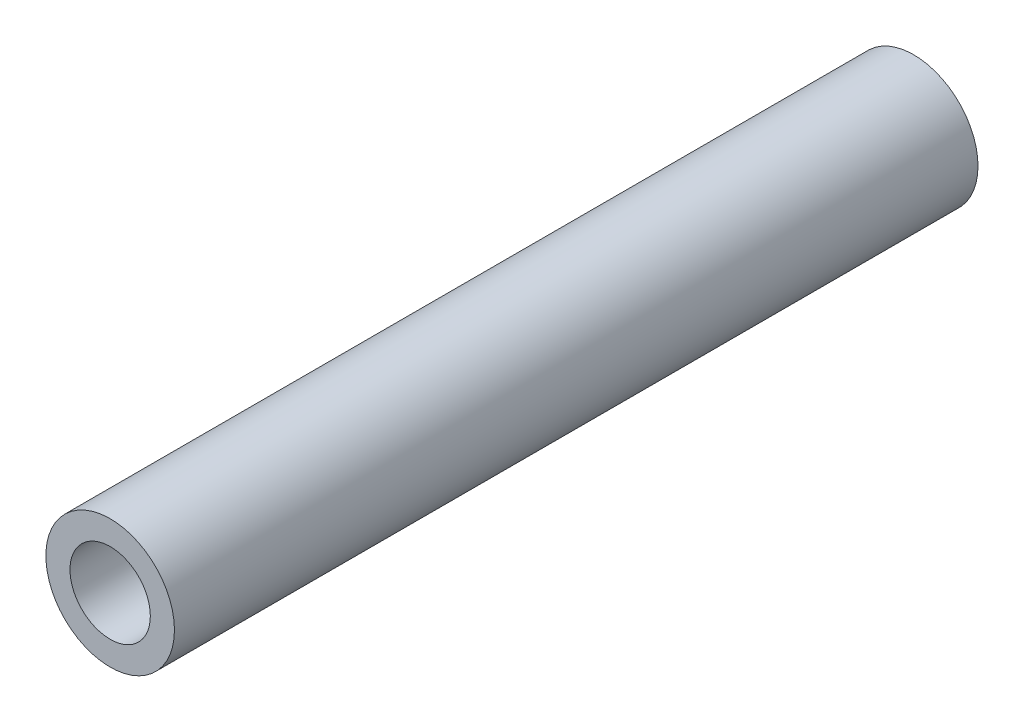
ISO-10303-21;
HEADER;
FILE_DESCRIPTION(('STEP AP214'),'2;1');
FILE_NAME('part.step','',(''),(''),'','','');
FILE_SCHEMA(('AUTOMOTIVE_DESIGN { 1 0 10303 214 1 1 1 1 }'));
ENDSEC;
DATA;
#1=APPLICATION_CONTEXT('core data for automotive mechanical design processes');
#2=APPLICATION_PROTOCOL_DEFINITION('international standard','automotive_design',2000,#1);
#3=PRODUCT_CONTEXT('',#1,'mechanical');
#4=PRODUCT('Part','Part','',(#3));
#5=PRODUCT_RELATED_PRODUCT_CATEGORY('part','',(#4));
#6=PRODUCT_DEFINITION_FORMATION('','',#4);
#7=PRODUCT_DEFINITION_CONTEXT('part definition',#1,'design');
#8=PRODUCT_DEFINITION('design','',#6,#7);
#9=PRODUCT_DEFINITION_SHAPE('','',#8);
#10=(LENGTH_UNIT() NAMED_UNIT(*) SI_UNIT(.MILLI.,.METRE.));
#11=(NAMED_UNIT(*) PLANE_ANGLE_UNIT() SI_UNIT($,.RADIAN.));
#12=(NAMED_UNIT(*) SI_UNIT($,.STERADIAN.) SOLID_ANGLE_UNIT());
#13=UNCERTAINTY_MEASURE_WITH_UNIT(LENGTH_MEASURE(1.E-05),#10,'distance_accuracy_value','');
#14=(GEOMETRIC_REPRESENTATION_CONTEXT(3) GLOBAL_UNCERTAINTY_ASSIGNED_CONTEXT((#13)) GLOBAL_UNIT_ASSIGNED_CONTEXT((#10,
#11,#12)) REPRESENTATION_CONTEXT('',''));
#15=CARTESIAN_POINT('',(0.,0.,0.));
#16=DIRECTION('',(0.,0.,1.));
#17=DIRECTION('',(1.,0.,0.));
#18=AXIS2_PLACEMENT_3D('',#15,#16,#17);
#19=CARTESIAN_POINT('',(-15.0000000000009,0.,100.));
#20=DIRECTION('',(0.,0.,1.));
#21=DIRECTION('',(1.,0.,0.));
#22=AXIS2_PLACEMENT_3D('',#19,#20,#21);
#23=PLANE('',#22);
#24=CARTESIAN_POINT('',(-15.0000000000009,0.,100.));
#25=DIRECTION('',(0.,0.,1.));
#26=DIRECTION('',(1.,0.,0.));
#27=AXIS2_PLACEMENT_3D('',#24,#25,#26);
#28=CIRCLE('',#27,8.);
#29=CARTESIAN_POINT('',(-7.00000000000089,0.,100.));
#30=VERTEX_POINT('',#29);
#31=EDGE_CURVE('E10',#30,#30,#28,.T.);
#32=ORIENTED_EDGE('',*,*,#31,.T.);
#33=EDGE_LOOP('',(#32));
#34=FACE_BOUND('',#33,.T.);
#35=CARTESIAN_POINT('',(-15.0000000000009,0.,100.));
#36=DIRECTION('',(0.,0.,1.));
#37=DIRECTION('',(1.,0.,0.));
#38=AXIS2_PLACEMENT_3D('',#35,#36,#37);
#39=CIRCLE('',#38,5.);
#40=CARTESIAN_POINT('',(-10.0000000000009,0.,100.));
#41=VERTEX_POINT('',#40);
#42=EDGE_CURVE('E33',#41,#41,#39,.T.);
#43=ORIENTED_EDGE('',*,*,#42,.F.);
#44=EDGE_LOOP('',(#43));
#45=FACE_BOUND('',#44,.T.);
#46=ADVANCED_FACE('F22',(#34,#45),#23,.T.);
#47=CARTESIAN_POINT('',(-15.0000000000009,0.,0.));
#48=DIRECTION('',(0.,0.,1.));
#49=DIRECTION('',(1.,0.,0.));
#50=AXIS2_PLACEMENT_3D('',#47,#48,#49);
#51=PLANE('',#50);
#52=CARTESIAN_POINT('',(-15.0000000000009,0.,0.));
#53=DIRECTION('',(0.,0.,1.));
#54=DIRECTION('',(1.,0.,0.));
#55=AXIS2_PLACEMENT_3D('',#52,#53,#54);
#56=CIRCLE('',#55,8.);
#57=CARTESIAN_POINT('',(-7.00000000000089,0.,0.));
#58=VERTEX_POINT('',#57);
#59=EDGE_CURVE('E29',#58,#58,#56,.T.);
#60=ORIENTED_EDGE('',*,*,#59,.F.);
#61=EDGE_LOOP('',(#60));
#62=FACE_BOUND('',#61,.T.);
#63=CARTESIAN_POINT('',(-15.0000000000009,0.,0.));
#64=DIRECTION('',(0.,0.,1.));
#65=DIRECTION('',(1.,0.,0.));
#66=AXIS2_PLACEMENT_3D('',#63,#64,#65);
#67=CIRCLE('',#66,5.);
#68=CARTESIAN_POINT('',(-10.0000000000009,0.,0.));
#69=VERTEX_POINT('',#68);
#70=EDGE_CURVE('E37',#69,#69,#67,.T.);
#71=ORIENTED_EDGE('',*,*,#70,.T.);
#72=EDGE_LOOP('',(#71));
#73=FACE_BOUND('',#72,.T.);
#74=ADVANCED_FACE('F43',(#62,#73),#51,.F.);
#75=CARTESIAN_POINT('',(-15.0000000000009,0.,100.));
#76=DIRECTION('',(0.,0.,-1.));
#77=DIRECTION('',(-1.,0.,0.));
#78=AXIS2_PLACEMENT_3D('',#75,#76,#77);
#79=CYLINDRICAL_SURFACE('',#78,8.);
#80=ORIENTED_EDGE('',*,*,#31,.F.);
#81=EDGE_LOOP('',(#80));
#82=FACE_BOUND('',#81,.T.);
#83=ORIENTED_EDGE('',*,*,#59,.T.);
#84=EDGE_LOOP('',(#83));
#85=FACE_BOUND('',#84,.T.);
#86=ADVANCED_FACE('F24',(#82,#85),#79,.T.);
#87=CARTESIAN_POINT('',(-15.0000000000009,0.,100.));
#88=DIRECTION('',(0.,0.,-1.));
#89=DIRECTION('',(-1.,0.,0.));
#90=AXIS2_PLACEMENT_3D('',#87,#88,#89);
#91=CYLINDRICAL_SURFACE('',#90,5.);
#92=ORIENTED_EDGE('',*,*,#70,.F.);
#93=EDGE_LOOP('',(#92));
#94=FACE_BOUND('',#93,.T.);
#95=ORIENTED_EDGE('',*,*,#42,.T.);
#96=EDGE_LOOP('',(#95));
#97=FACE_BOUND('',#96,.T.);
#98=ADVANCED_FACE('F45',(#94,#97),#91,.F.);
#99=CLOSED_SHELL('',(#46,#74,#86,#98));
#100=MANIFOLD_SOLID_BREP('B2',#99);
#101=ADVANCED_BREP_SHAPE_REPRESENTATION('',(#18,#100),#14);
#102=SHAPE_DEFINITION_REPRESENTATION(#9,#101);
ENDSEC;
END-ISO-10303-21;
